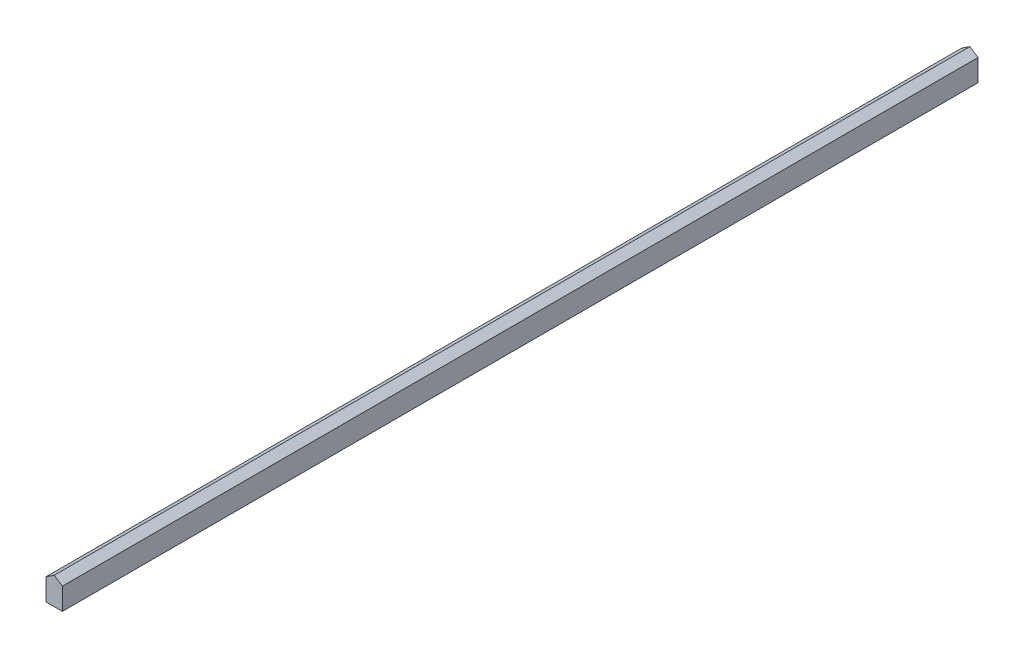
from build123d import *

# Parameters (mm, degrees)
ESQUISSE1_W             = 15
ESQUISSE1_H             = 25
EXTRUSION1_DEPTH        = 840
ENL_V_MAT_EXTRU_2_DEPTH = 841.505800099


with BuildPart() as part:
    # Esquisse1 → Extrusion1 (new body)
    with BuildSketch(Plane.XY):
        with Locations((7.5, 12.5)):
            Rectangle(ESQUISSE1_W, ESQUISSE1_H)
    extrude(amount=EXTRUSION1_DEPTH)

    # Esquisse2 → Enl_v. mat.-Extru.2 (cut, through all)
    with BuildSketch(Plane.XY.offset(840)):
        Polygon((7.5, 25), (0, 20.038461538), (0, 31.423357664), (15, 31.423357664), (15, 20.038461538), align=None)
    extrude(amount=-ENL_V_MAT_EXTRU_2_DEPTH, mode=Mode.SUBTRACT)


solid = part.part
